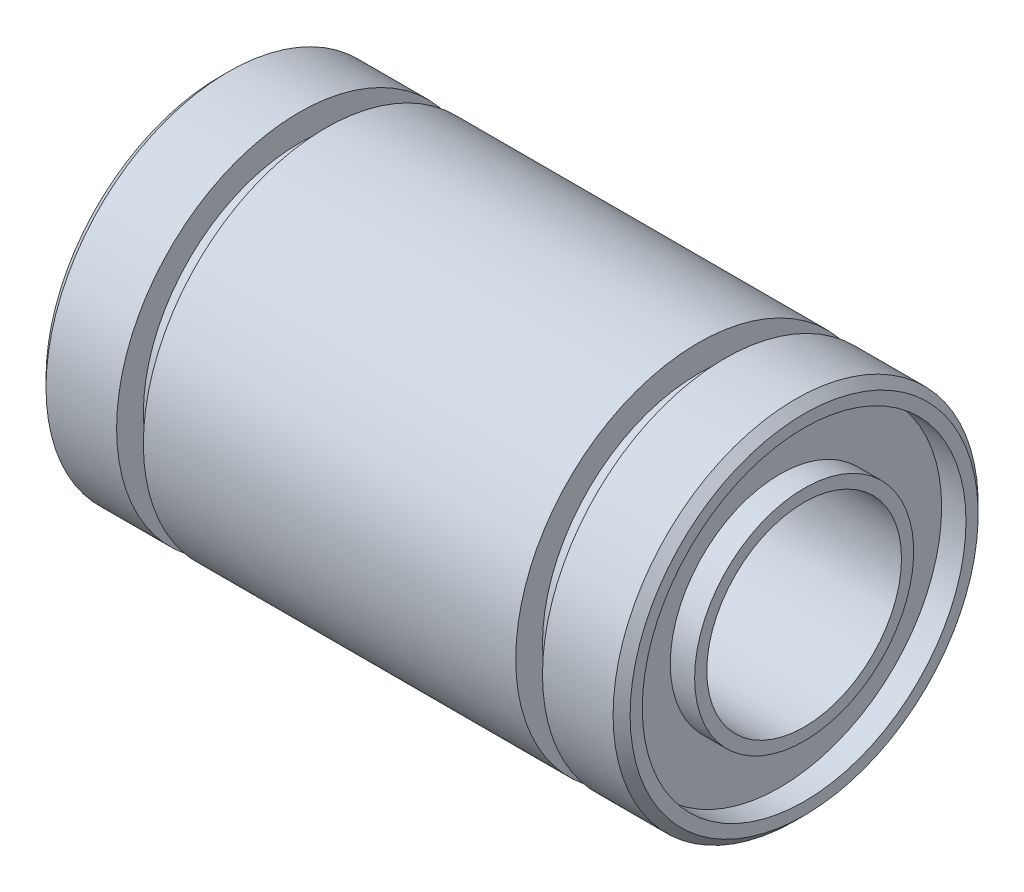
from build123d import *


with BuildPart() as part:
    # Sketch1 → Revolve1 (revolve)
    with BuildSketch(Plane.XY, mode=Mode.PRIVATE) as revolve1_sk:
        Polygon((11.65, 7.5), (12, 7.15), (12, 6.65), (11, 6.65), (11, 4.5), (12, 4.5), (12, 4), (-12, 4), (-12, 4.5), (-11, 4.5), (-11, 6.65), (-12, 6.65), (-12, 7.15), (-11.65, 7.5), (-8.75, 7.5), (-8.75, 6.4), (-7.65, 6.4), (-7.65, 7.5), (7.65, 7.5), (7.65, 6.4), (8.75, 6.4), (8.75, 7.5), align=None)
    revolve(revolve1_sk.sketch.rotate(Axis((-45.689505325, 0, 0), (1, 0, 0)), 90), axis=Axis((-45.689505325, 0, 0), (1, 0, 0)))


solid = part.part
